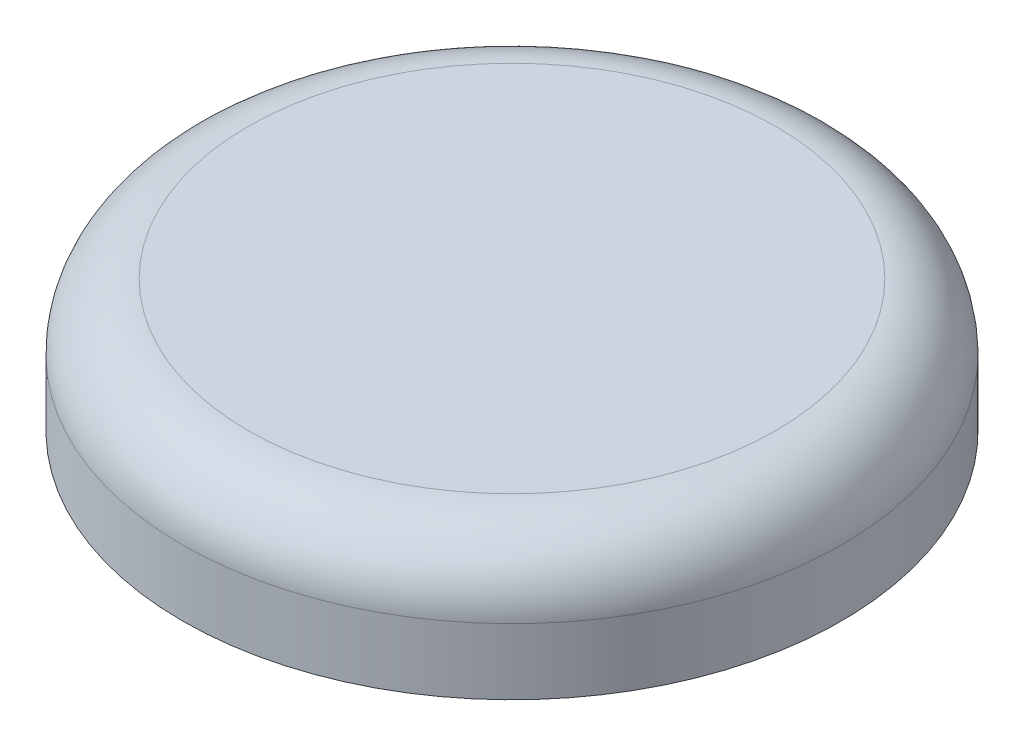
ISO-10303-21;
HEADER;
FILE_DESCRIPTION(('STEP AP214'),'2;1');
FILE_NAME('part.step','',(''),(''),'','','');
FILE_SCHEMA(('AUTOMOTIVE_DESIGN { 1 0 10303 214 1 1 1 1 }'));
ENDSEC;
DATA;
#1=APPLICATION_CONTEXT('core data for automotive mechanical design processes');
#2=APPLICATION_PROTOCOL_DEFINITION('international standard','automotive_design',2000,#1);
#3=PRODUCT_CONTEXT('',#1,'mechanical');
#4=PRODUCT('Part','Part','',(#3));
#5=PRODUCT_RELATED_PRODUCT_CATEGORY('part','',(#4));
#6=PRODUCT_DEFINITION_FORMATION('','',#4);
#7=PRODUCT_DEFINITION_CONTEXT('part definition',#1,'design');
#8=PRODUCT_DEFINITION('design','',#6,#7);
#9=PRODUCT_DEFINITION_SHAPE('','',#8);
#10=(LENGTH_UNIT() NAMED_UNIT(*) SI_UNIT(.MILLI.,.METRE.));
#11=(NAMED_UNIT(*) PLANE_ANGLE_UNIT() SI_UNIT($,.RADIAN.));
#12=(NAMED_UNIT(*) SI_UNIT($,.STERADIAN.) SOLID_ANGLE_UNIT());
#13=UNCERTAINTY_MEASURE_WITH_UNIT(LENGTH_MEASURE(1.E-05),#10,'distance_accuracy_value','');
#14=(GEOMETRIC_REPRESENTATION_CONTEXT(3) GLOBAL_UNCERTAINTY_ASSIGNED_CONTEXT((#13)) GLOBAL_UNIT_ASSIGNED_CONTEXT((#10,
#11,#12)) REPRESENTATION_CONTEXT('',''));
#15=CARTESIAN_POINT('',(0.,0.,0.));
#16=DIRECTION('',(0.,0.,1.));
#17=DIRECTION('',(1.,0.,0.));
#18=AXIS2_PLACEMENT_3D('',#15,#16,#17);
#19=CARTESIAN_POINT('',(0.,5.,0.));
#20=DIRECTION('',(0.,-1.,0.));
#21=DIRECTION('',(0.,0.,-1.));
#22=AXIS2_PLACEMENT_3D('',#19,#20,#21);
#23=CYLINDRICAL_SURFACE('',#22,25.);
#24=CARTESIAN_POINT('',(0.,0.,0.));
#25=DIRECTION('',(0.,1.,0.));
#26=DIRECTION('',(0.,0.,1.));
#27=AXIS2_PLACEMENT_3D('',#24,#25,#26);
#28=CIRCLE('',#27,25.);
#29=CARTESIAN_POINT('',(0.,0.,25.));
#30=VERTEX_POINT('',#29);
#31=EDGE_CURVE('E10',#30,#30,#28,.F.);
#32=ORIENTED_EDGE('',*,*,#31,.T.);
#33=EDGE_LOOP('',(#32));
#34=FACE_BOUND('',#33,.T.);
#35=CARTESIAN_POINT('',(0.,-5.,0.));
#36=DIRECTION('',(0.,1.,0.));
#37=DIRECTION('',(0.,0.,1.));
#38=AXIS2_PLACEMENT_3D('',#35,#36,#37);
#39=CIRCLE('',#38,25.);
#40=CARTESIAN_POINT('',(0.,-5.,25.));
#41=VERTEX_POINT('',#40);
#42=EDGE_CURVE('E34',#41,#41,#39,.T.);
#43=ORIENTED_EDGE('',*,*,#42,.T.);
#44=EDGE_LOOP('',(#43));
#45=FACE_BOUND('',#44,.T.);
#46=ADVANCED_FACE('F24',(#34,#45),#23,.T.);
#47=CARTESIAN_POINT('',(0.,5.,0.));
#48=DIRECTION('',(0.,1.,0.));
#49=DIRECTION('',(0.,0.,1.));
#50=AXIS2_PLACEMENT_3D('',#47,#48,#49);
#51=PLANE('',#50);
#52=CARTESIAN_POINT('',(0.,5.,0.));
#53=DIRECTION('',(0.,1.,0.));
#54=DIRECTION('',(0.,0.,1.));
#55=AXIS2_PLACEMENT_3D('',#52,#53,#54);
#56=CIRCLE('',#55,20.);
#57=CARTESIAN_POINT('',(0.,5.,20.));
#58=VERTEX_POINT('',#57);
#59=EDGE_CURVE('E30',#58,#58,#56,.T.);
#60=ORIENTED_EDGE('',*,*,#59,.T.);
#61=EDGE_LOOP('',(#60));
#62=FACE_BOUND('',#61,.T.);
#63=ADVANCED_FACE('F64',(#62),#51,.T.);
#64=CARTESIAN_POINT('',(0.,-5.,0.));
#65=DIRECTION('',(0.,1.,0.));
#66=DIRECTION('',(0.,0.,1.));
#67=AXIS2_PLACEMENT_3D('',#64,#65,#66);
#68=PLANE('',#67);
#69=CARTESIAN_POINT('',(0.,-5.,0.));
#70=DIRECTION('',(0.,1.,0.));
#71=DIRECTION('',(0.,0.,1.));
#72=AXIS2_PLACEMENT_3D('',#69,#70,#71);
#73=CIRCLE('',#72,24.);
#74=CARTESIAN_POINT('',(0.,-5.,24.));
#75=VERTEX_POINT('',#74);
#76=EDGE_CURVE('E41',#75,#75,#73,.T.);
#77=ORIENTED_EDGE('',*,*,#76,.T.);
#78=EDGE_LOOP('',(#77));
#79=FACE_BOUND('',#78,.T.);
#80=ORIENTED_EDGE('',*,*,#42,.F.);
#81=EDGE_LOOP('',(#80));
#82=FACE_BOUND('',#81,.T.);
#83=ADVANCED_FACE('F61',(#79,#82),#68,.F.);
#84=CARTESIAN_POINT('',(0.,0.,0.));
#85=DIRECTION('',(0.,1.,0.));
#86=DIRECTION('',(0.,0.,1.));
#87=AXIS2_PLACEMENT_3D('',#84,#85,#86);
#88=TOROIDAL_SURFACE('',#87,20.,5.);
#89=ORIENTED_EDGE('',*,*,#31,.F.);
#90=EDGE_LOOP('',(#89));
#91=FACE_BOUND('',#90,.T.);
#92=ORIENTED_EDGE('',*,*,#59,.F.);
#93=EDGE_LOOP('',(#92));
#94=FACE_BOUND('',#93,.T.);
#95=ADVANCED_FACE('F57',(#91,#94),#88,.T.);
#96=CARTESIAN_POINT('',(0.,5.,0.));
#97=DIRECTION('',(0.,-1.,0.));
#98=DIRECTION('',(0.,0.,-1.));
#99=AXIS2_PLACEMENT_3D('',#96,#97,#98);
#100=CYLINDRICAL_SURFACE('',#99,24.);
#101=CARTESIAN_POINT('',(0.,0.,0.));
#102=DIRECTION('',(0.,-1.,0.));
#103=DIRECTION('',(0.,0.,-1.));
#104=AXIS2_PLACEMENT_3D('',#101,#102,#103);
#105=CIRCLE('',#104,24.);
#106=CARTESIAN_POINT('',(0.,0.,-24.));
#107=VERTEX_POINT('',#106);
#108=EDGE_CURVE('E38',#107,#107,#105,.T.);
#109=ORIENTED_EDGE('',*,*,#108,.F.);
#110=EDGE_LOOP('',(#109));
#111=FACE_BOUND('',#110,.T.);
#112=ORIENTED_EDGE('',*,*,#76,.F.);
#113=EDGE_LOOP('',(#112));
#114=FACE_BOUND('',#113,.T.);
#115=ADVANCED_FACE('F53',(#111,#114),#100,.F.);
#116=CARTESIAN_POINT('',(0.,4.,0.));
#117=DIRECTION('',(0.,1.,0.));
#118=DIRECTION('',(0.,0.,1.));
#119=AXIS2_PLACEMENT_3D('',#116,#117,#118);
#120=PLANE('',#119);
#121=CARTESIAN_POINT('',(0.,4.,0.));
#122=DIRECTION('',(0.,1.,0.));
#123=DIRECTION('',(0.,0.,1.));
#124=AXIS2_PLACEMENT_3D('',#121,#122,#123);
#125=CIRCLE('',#124,20.);
#126=CARTESIAN_POINT('',(0.,4.,20.));
#127=VERTEX_POINT('',#126);
#128=EDGE_CURVE('E44',#127,#127,#125,.T.);
#129=ORIENTED_EDGE('',*,*,#128,.F.);
#130=EDGE_LOOP('',(#129));
#131=FACE_BOUND('',#130,.T.);
#132=ADVANCED_FACE('F56',(#131),#120,.F.);
#133=CARTESIAN_POINT('',(0.,0.,0.));
#134=DIRECTION('',(0.,1.,0.));
#135=DIRECTION('',(0.,0.,1.));
#136=AXIS2_PLACEMENT_3D('',#133,#134,#135);
#137=TOROIDAL_SURFACE('',#136,20.,4.);
#138=ORIENTED_EDGE('',*,*,#108,.T.);
#139=EDGE_LOOP('',(#138));
#140=FACE_BOUND('',#139,.T.);
#141=ORIENTED_EDGE('',*,*,#128,.T.);
#142=EDGE_LOOP('',(#141));
#143=FACE_BOUND('',#142,.T.);
#144=ADVANCED_FACE('F50',(#140,#143),#137,.F.);
#145=CLOSED_SHELL('',(#46,#63,#83,#95,#115,#132,#144));
#146=MANIFOLD_SOLID_BREP('B2',#145);
#147=ADVANCED_BREP_SHAPE_REPRESENTATION('',(#18,#146),#14);
#148=SHAPE_DEFINITION_REPRESENTATION(#9,#147);
ENDSEC;
END-ISO-10303-21;
